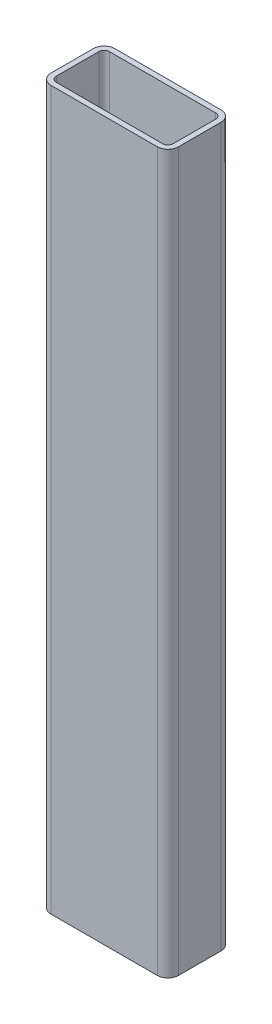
ISO-10303-21;
HEADER;
FILE_DESCRIPTION(('STEP AP214'),'2;1');
FILE_NAME('part.step','',(''),(''),'','','');
FILE_SCHEMA(('AUTOMOTIVE_DESIGN { 1 0 10303 214 1 1 1 1 }'));
ENDSEC;
DATA;
#1=APPLICATION_CONTEXT('core data for automotive mechanical design processes');
#2=APPLICATION_PROTOCOL_DEFINITION('international standard','automotive_design',2000,#1);
#3=PRODUCT_CONTEXT('',#1,'mechanical');
#4=PRODUCT('Part','Part','',(#3));
#5=PRODUCT_RELATED_PRODUCT_CATEGORY('part','',(#4));
#6=PRODUCT_DEFINITION_FORMATION('','',#4);
#7=PRODUCT_DEFINITION_CONTEXT('part definition',#1,'design');
#8=PRODUCT_DEFINITION('design','',#6,#7);
#9=PRODUCT_DEFINITION_SHAPE('','',#8);
#10=(LENGTH_UNIT() NAMED_UNIT(*) SI_UNIT(.MILLI.,.METRE.));
#11=(NAMED_UNIT(*) PLANE_ANGLE_UNIT() SI_UNIT($,.RADIAN.));
#12=(NAMED_UNIT(*) SI_UNIT($,.STERADIAN.) SOLID_ANGLE_UNIT());
#13=UNCERTAINTY_MEASURE_WITH_UNIT(LENGTH_MEASURE(1.E-05),#10,'distance_accuracy_value','');
#14=(GEOMETRIC_REPRESENTATION_CONTEXT(3) GLOBAL_UNCERTAINTY_ASSIGNED_CONTEXT((#13)) GLOBAL_UNIT_ASSIGNED_CONTEXT((#10,
#11,#12)) REPRESENTATION_CONTEXT('',''));
#15=CARTESIAN_POINT('',(0.,0.,0.));
#16=DIRECTION('',(0.,0.,1.));
#17=DIRECTION('',(1.,0.,0.));
#18=AXIS2_PLACEMENT_3D('',#15,#16,#17);
#19=CARTESIAN_POINT('',(-1118.46174535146,-2097.12163758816,-25.3999999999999));
#20=DIRECTION('',(0.,1.,0.));
#21=DIRECTION('',(0.,0.,1.));
#22=AXIS2_PLACEMENT_3D('',#19,#20,#21);
#23=CYLINDRICAL_SURFACE('',#22,25.4);
#24=CARTESIAN_POINT('',(-1118.46174535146,-382.621637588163,-25.3999999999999));
#25=DIRECTION('',(0.,-1.,0.));
#26=DIRECTION('',(0.,0.,-1.));
#27=AXIS2_PLACEMENT_3D('',#24,#25,#26);
#28=CIRCLE('',#27,25.4);
#29=CARTESIAN_POINT('',(-1118.46174535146,-382.621637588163,1.80411241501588E-13));
#30=VERTEX_POINT('',#29);
#31=CARTESIAN_POINT('',(-1143.86174535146,-382.621637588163,-25.4));
#32=VERTEX_POINT('',#31);
#33=EDGE_CURVE('E232',#30,#32,#28,.T.);
#34=ORIENTED_EDGE('',*,*,#33,.T.);
#35=DIRECTION('',(0.,1.,0.));
#36=VECTOR('',#35,1.);
#37=CARTESIAN_POINT('',(-1143.86174535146,-2097.12163758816,-25.4));
#38=LINE('',#37,#36);
#39=CARTESIAN_POINT('',(-1143.86174535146,-2097.12163758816,-25.4));
#40=VERTEX_POINT('',#39);
#41=EDGE_CURVE('E12',#40,#32,#38,.T.);
#42=ORIENTED_EDGE('',*,*,#41,.F.);
#43=CARTESIAN_POINT('',(-1118.46174535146,-2097.12163758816,-25.3999999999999));
#44=DIRECTION('',(0.,-1.,0.));
#45=DIRECTION('',(0.,0.,-1.));
#46=AXIS2_PLACEMENT_3D('',#43,#44,#45);
#47=CIRCLE('',#46,25.4);
#48=CARTESIAN_POINT('',(-1118.46174535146,-2097.12163758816,1.80411241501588E-13));
#49=VERTEX_POINT('',#48);
#50=EDGE_CURVE('E310',#49,#40,#47,.T.);
#51=ORIENTED_EDGE('',*,*,#50,.F.);
#52=DIRECTION('',(0.,1.,0.));
#53=VECTOR('',#52,1.);
#54=CARTESIAN_POINT('',(-1118.46174535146,-2097.12163758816,1.80411241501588E-13));
#55=LINE('',#54,#53);
#56=EDGE_CURVE('E247',#49,#30,#55,.T.);
#57=ORIENTED_EDGE('',*,*,#56,.T.);
#58=EDGE_LOOP('',(#34,#42,#51,#57));
#59=FACE_BOUND('',#58,.T.);
#60=ADVANCED_FACE('F60',(#59),#23,.T.);
#61=CARTESIAN_POINT('',(-1143.86174535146,-2097.12163758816,-25.4));
#62=DIRECTION('',(1.,0.,0.));
#63=DIRECTION('',(0.,0.,-1.));
#64=AXIS2_PLACEMENT_3D('',#61,#62,#63);
#65=PLANE('',#64);
#66=DIRECTION('',(0.,0.,-1.));
#67=VECTOR('',#66,1.);
#68=CARTESIAN_POINT('',(-1143.86174535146,-382.621637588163,-25.4));
#69=LINE('',#68,#67);
#70=CARTESIAN_POINT('',(-1143.86174535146,-382.621637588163,-127.));
#71=VERTEX_POINT('',#70);
#72=EDGE_CURVE('E235',#32,#71,#69,.T.);
#73=ORIENTED_EDGE('',*,*,#72,.T.);
#74=DIRECTION('',(0.,1.,0.));
#75=VECTOR('',#74,1.);
#76=CARTESIAN_POINT('',(-1143.86174535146,-2097.12163758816,-127.));
#77=LINE('',#76,#75);
#78=CARTESIAN_POINT('',(-1143.86174535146,-2097.12163758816,-127.));
#79=VERTEX_POINT('',#78);
#80=EDGE_CURVE('E70',#79,#71,#77,.T.);
#81=ORIENTED_EDGE('',*,*,#80,.F.);
#82=DIRECTION('',(0.,0.,-1.));
#83=VECTOR('',#82,1.);
#84=CARTESIAN_POINT('',(-1143.86174535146,-2097.12163758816,-25.4));
#85=LINE('',#84,#83);
#86=EDGE_CURVE('E312',#40,#79,#85,.T.);
#87=ORIENTED_EDGE('',*,*,#86,.F.);
#88=ORIENTED_EDGE('',*,*,#41,.T.);
#89=EDGE_LOOP('',(#73,#81,#87,#88));
#90=FACE_BOUND('',#89,.T.);
#91=ADVANCED_FACE('F347',(#90),#65,.F.);
#92=CARTESIAN_POINT('',(-1118.46174535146,-2097.12163758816,-127.));
#93=DIRECTION('',(0.,1.,0.));
#94=DIRECTION('',(0.,0.,1.));
#95=AXIS2_PLACEMENT_3D('',#92,#93,#94);
#96=CYLINDRICAL_SURFACE('',#95,25.4000000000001);
#97=CARTESIAN_POINT('',(-1118.46174535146,-382.621637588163,-127.));
#98=DIRECTION('',(0.,-1.,0.));
#99=DIRECTION('',(0.,0.,-1.));
#100=AXIS2_PLACEMENT_3D('',#97,#98,#99);
#101=CIRCLE('',#100,25.4000000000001);
#102=CARTESIAN_POINT('',(-1118.46174535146,-382.621637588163,-152.4));
#103=VERTEX_POINT('',#102);
#104=EDGE_CURVE('E237',#71,#103,#101,.T.);
#105=ORIENTED_EDGE('',*,*,#104,.T.);
#106=DIRECTION('',(0.,1.,0.));
#107=VECTOR('',#106,1.);
#108=CARTESIAN_POINT('',(-1118.46174535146,-2097.12163758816,-152.4));
#109=LINE('',#108,#107);
#110=CARTESIAN_POINT('',(-1118.46174535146,-2097.12163758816,-152.4));
#111=VERTEX_POINT('',#110);
#112=EDGE_CURVE('E254',#111,#103,#109,.T.);
#113=ORIENTED_EDGE('',*,*,#112,.F.);
#114=CARTESIAN_POINT('',(-1118.46174535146,-2097.12163758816,-127.));
#115=DIRECTION('',(0.,-1.,0.));
#116=DIRECTION('',(0.,0.,-1.));
#117=AXIS2_PLACEMENT_3D('',#114,#115,#116);
#118=CIRCLE('',#117,25.4000000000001);
#119=EDGE_CURVE('E314',#79,#111,#118,.T.);
#120=ORIENTED_EDGE('',*,*,#119,.F.);
#121=ORIENTED_EDGE('',*,*,#80,.T.);
#122=EDGE_LOOP('',(#105,#113,#120,#121));
#123=FACE_BOUND('',#122,.T.);
#124=ADVANCED_FACE('F352',(#123),#96,.T.);
#125=CARTESIAN_POINT('',(-864.461745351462,-2097.12163758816,-152.399999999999));
#126=DIRECTION('',(0.,0.,1.));
#127=DIRECTION('',(1.,0.,0.));
#128=AXIS2_PLACEMENT_3D('',#125,#126,#127);
#129=PLANE('',#128);
#130=DIRECTION('',(1.,0.,0.));
#131=VECTOR('',#130,1.);
#132=CARTESIAN_POINT('',(-864.461745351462,-382.621637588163,-152.399999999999));
#133=LINE('',#132,#131);
#134=CARTESIAN_POINT('',(-864.461745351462,-382.621637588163,-152.399999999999));
#135=VERTEX_POINT('',#134);
#136=EDGE_CURVE('E239',#103,#135,#133,.T.);
#137=ORIENTED_EDGE('',*,*,#136,.T.);
#138=DIRECTION('',(0.,1.,0.));
#139=VECTOR('',#138,1.);
#140=CARTESIAN_POINT('',(-864.461745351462,-2097.12163758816,-152.399999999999));
#141=LINE('',#140,#139);
#142=CARTESIAN_POINT('',(-864.461745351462,-2097.12163758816,-152.399999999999));
#143=VERTEX_POINT('',#142);
#144=EDGE_CURVE('E251',#143,#135,#141,.T.);
#145=ORIENTED_EDGE('',*,*,#144,.F.);
#146=DIRECTION('',(1.,0.,0.));
#147=VECTOR('',#146,1.);
#148=CARTESIAN_POINT('',(-864.461745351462,-2097.12163758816,-152.399999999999));
#149=LINE('',#148,#147);
#150=EDGE_CURVE('E316',#111,#143,#149,.T.);
#151=ORIENTED_EDGE('',*,*,#150,.F.);
#152=ORIENTED_EDGE('',*,*,#112,.T.);
#153=EDGE_LOOP('',(#137,#145,#151,#152));
#154=FACE_BOUND('',#153,.T.);
#155=ADVANCED_FACE('F322',(#154),#129,.F.);
#156=CARTESIAN_POINT('',(-864.461745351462,-2097.12163758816,-126.999999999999));
#157=DIRECTION('',(0.,1.,0.));
#158=DIRECTION('',(0.,0.,1.));
#159=AXIS2_PLACEMENT_3D('',#156,#157,#158);
#160=CYLINDRICAL_SURFACE('',#159,25.4);
#161=CARTESIAN_POINT('',(-864.461745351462,-382.621637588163,-126.999999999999));
#162=DIRECTION('',(0.,-1.,0.));
#163=DIRECTION('',(0.,0.,-1.));
#164=AXIS2_PLACEMENT_3D('',#161,#162,#163);
#165=CIRCLE('',#164,25.4);
#166=CARTESIAN_POINT('',(-839.061745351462,-382.621637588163,-126.999999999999));
#167=VERTEX_POINT('',#166);
#168=EDGE_CURVE('E241',#135,#167,#165,.T.);
#169=ORIENTED_EDGE('',*,*,#168,.T.);
#170=DIRECTION('',(0.,1.,0.));
#171=VECTOR('',#170,1.);
#172=CARTESIAN_POINT('',(-839.061745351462,-2097.12163758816,-126.999999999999));
#173=LINE('',#172,#171);
#174=CARTESIAN_POINT('',(-839.061745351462,-2097.12163758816,-126.999999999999));
#175=VERTEX_POINT('',#174);
#176=EDGE_CURVE('E199',#175,#167,#173,.T.);
#177=ORIENTED_EDGE('',*,*,#176,.F.);
#178=CARTESIAN_POINT('',(-864.461745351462,-2097.12163758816,-126.999999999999));
#179=DIRECTION('',(0.,-1.,0.));
#180=DIRECTION('',(0.,0.,-1.));
#181=AXIS2_PLACEMENT_3D('',#178,#179,#180);
#182=CIRCLE('',#181,25.4);
#183=EDGE_CURVE('E190',#143,#175,#182,.T.);
#184=ORIENTED_EDGE('',*,*,#183,.F.);
#185=ORIENTED_EDGE('',*,*,#144,.T.);
#186=EDGE_LOOP('',(#169,#177,#184,#185));
#187=FACE_BOUND('',#186,.T.);
#188=ADVANCED_FACE('F326',(#187),#160,.T.);
#189=CARTESIAN_POINT('',(-839.061745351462,-2097.12163758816,-126.999999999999));
#190=DIRECTION('',(-1.,0.,0.));
#191=DIRECTION('',(0.,0.,1.));
#192=AXIS2_PLACEMENT_3D('',#189,#190,#191);
#193=PLANE('',#192);
#194=DIRECTION('',(0.,0.,1.));
#195=VECTOR('',#194,1.);
#196=CARTESIAN_POINT('',(-839.061745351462,-382.621637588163,-126.999999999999));
#197=LINE('',#196,#195);
#198=CARTESIAN_POINT('',(-839.061745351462,-382.621637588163,-25.3999999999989));
#199=VERTEX_POINT('',#198);
#200=EDGE_CURVE('E198',#167,#199,#197,.T.);
#201=ORIENTED_EDGE('',*,*,#200,.T.);
#202=DIRECTION('',(0.,1.,0.));
#203=VECTOR('',#202,1.);
#204=CARTESIAN_POINT('',(-839.061745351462,-2097.12163758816,-25.3999999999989));
#205=LINE('',#204,#203);
#206=CARTESIAN_POINT('',(-839.061745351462,-2097.12163758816,-25.3999999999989));
#207=VERTEX_POINT('',#206);
#208=EDGE_CURVE('E195',#207,#199,#205,.T.);
#209=ORIENTED_EDGE('',*,*,#208,.F.);
#210=DIRECTION('',(0.,0.,1.));
#211=VECTOR('',#210,1.);
#212=CARTESIAN_POINT('',(-839.061745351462,-2097.12163758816,-126.999999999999));
#213=LINE('',#212,#211);
#214=EDGE_CURVE('E184',#175,#207,#213,.T.);
#215=ORIENTED_EDGE('',*,*,#214,.F.);
#216=ORIENTED_EDGE('',*,*,#176,.T.);
#217=EDGE_LOOP('',(#201,#209,#215,#216));
#218=FACE_BOUND('',#217,.T.);
#219=ADVANCED_FACE('F196',(#218),#193,.F.);
#220=CARTESIAN_POINT('',(-864.461745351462,-2097.12163758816,-25.399999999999));
#221=DIRECTION('',(0.,1.,0.));
#222=DIRECTION('',(0.,0.,1.));
#223=AXIS2_PLACEMENT_3D('',#220,#221,#222);
#224=CYLINDRICAL_SURFACE('',#223,25.4000000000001);
#225=CARTESIAN_POINT('',(-864.461745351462,-382.621637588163,-25.399999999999));
#226=DIRECTION('',(0.,-1.,0.));
#227=DIRECTION('',(0.,0.,-1.));
#228=AXIS2_PLACEMENT_3D('',#225,#226,#227);
#229=CIRCLE('',#228,25.4000000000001);
#230=CARTESIAN_POINT('',(-864.461745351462,-382.621637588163,1.06858966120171E-12));
#231=VERTEX_POINT('',#230);
#232=EDGE_CURVE('E132',#199,#231,#229,.T.);
#233=ORIENTED_EDGE('',*,*,#232,.T.);
#234=DIRECTION('',(0.,1.,0.));
#235=VECTOR('',#234,1.);
#236=CARTESIAN_POINT('',(-864.461745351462,-2097.12163758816,1.06858966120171E-12));
#237=LINE('',#236,#235);
#238=CARTESIAN_POINT('',(-864.461745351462,-2097.12163758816,1.06858966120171E-12));
#239=VERTEX_POINT('',#238);
#240=EDGE_CURVE('E200',#239,#231,#237,.T.);
#241=ORIENTED_EDGE('',*,*,#240,.F.);
#242=CARTESIAN_POINT('',(-864.461745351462,-2097.12163758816,-25.399999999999));
#243=DIRECTION('',(0.,-1.,0.));
#244=DIRECTION('',(0.,0.,-1.));
#245=AXIS2_PLACEMENT_3D('',#242,#243,#244);
#246=CIRCLE('',#245,25.4000000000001);
#247=EDGE_CURVE('E188',#207,#239,#246,.T.);
#248=ORIENTED_EDGE('',*,*,#247,.F.);
#249=ORIENTED_EDGE('',*,*,#208,.T.);
#250=EDGE_LOOP('',(#233,#241,#248,#249));
#251=FACE_BOUND('',#250,.T.);
#252=ADVANCED_FACE('F202',(#251),#224,.T.);
#253=CARTESIAN_POINT('',(-1118.46174535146,-2097.12163758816,-127.));
#254=DIRECTION('',(0.,1.,0.));
#255=DIRECTION('',(0.,0.,1.));
#256=AXIS2_PLACEMENT_3D('',#253,#254,#255);
#257=CYLINDRICAL_SURFACE('',#256,12.7);
#258=CARTESIAN_POINT('',(-1118.46174535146,-382.621637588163,-127.));
#259=DIRECTION('',(0.,-1.,0.));
#260=DIRECTION('',(0.,0.,-1.));
#261=AXIS2_PLACEMENT_3D('',#258,#259,#260);
#262=CIRCLE('',#261,12.7);
#263=CARTESIAN_POINT('',(-1131.16174535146,-382.621637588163,-127.));
#264=VERTEX_POINT('',#263);
#265=CARTESIAN_POINT('',(-1118.46174535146,-382.621637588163,-139.7));
#266=VERTEX_POINT('',#265);
#267=EDGE_CURVE('E208',#264,#266,#262,.T.);
#268=ORIENTED_EDGE('',*,*,#267,.F.);
#269=DIRECTION('',(0.,1.,0.));
#270=VECTOR('',#269,1.);
#271=CARTESIAN_POINT('',(-1131.16174535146,-2097.12163758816,-127.));
#272=LINE('',#271,#270);
#273=CARTESIAN_POINT('',(-1131.16174535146,-2097.12163758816,-127.));
#274=VERTEX_POINT('',#273);
#275=EDGE_CURVE('E64',#274,#264,#272,.T.);
#276=ORIENTED_EDGE('',*,*,#275,.F.);
#277=CARTESIAN_POINT('',(-1118.46174535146,-2097.12163758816,-127.));
#278=DIRECTION('',(0.,-1.,0.));
#279=DIRECTION('',(0.,0.,-1.));
#280=AXIS2_PLACEMENT_3D('',#277,#278,#279);
#281=CIRCLE('',#280,12.7);
#282=CARTESIAN_POINT('',(-1118.46174535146,-2097.12163758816,-139.7));
#283=VERTEX_POINT('',#282);
#284=EDGE_CURVE('E246',#274,#283,#281,.T.);
#285=ORIENTED_EDGE('',*,*,#284,.T.);
#286=DIRECTION('',(0.,1.,0.));
#287=VECTOR('',#286,1.);
#288=CARTESIAN_POINT('',(-1118.46174535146,-2097.12163758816,-139.7));
#289=LINE('',#288,#287);
#290=EDGE_CURVE('E204',#283,#266,#289,.T.);
#291=ORIENTED_EDGE('',*,*,#290,.T.);
#292=EDGE_LOOP('',(#268,#276,#285,#291));
#293=FACE_BOUND('',#292,.T.);
#294=ADVANCED_FACE('F62',(#293),#257,.F.);
#295=CARTESIAN_POINT('',(-1131.16174535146,-2097.12163758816,-25.4));
#296=DIRECTION('',(1.,0.,0.));
#297=DIRECTION('',(0.,0.,-1.));
#298=AXIS2_PLACEMENT_3D('',#295,#296,#297);
#299=PLANE('',#298);
#300=DIRECTION('',(0.,0.,-1.));
#301=VECTOR('',#300,1.);
#302=CARTESIAN_POINT('',(-1131.16174535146,-382.621637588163,-25.4));
#303=LINE('',#302,#301);
#304=CARTESIAN_POINT('',(-1131.16174535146,-382.621637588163,-25.4));
#305=VERTEX_POINT('',#304);
#306=EDGE_CURVE('E211',#305,#264,#303,.T.);
#307=ORIENTED_EDGE('',*,*,#306,.F.);
#308=DIRECTION('',(0.,1.,0.));
#309=VECTOR('',#308,1.);
#310=CARTESIAN_POINT('',(-1131.16174535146,-2097.12163758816,-25.4));
#311=LINE('',#310,#309);
#312=CARTESIAN_POINT('',(-1131.16174535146,-2097.12163758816,-25.4));
#313=VERTEX_POINT('',#312);
#314=EDGE_CURVE('E269',#313,#305,#311,.T.);
#315=ORIENTED_EDGE('',*,*,#314,.F.);
#316=DIRECTION('',(0.,0.,-1.));
#317=VECTOR('',#316,1.);
#318=CARTESIAN_POINT('',(-1131.16174535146,-2097.12163758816,-25.4));
#319=LINE('',#318,#317);
#320=EDGE_CURVE('E278',#313,#274,#319,.T.);
#321=ORIENTED_EDGE('',*,*,#320,.T.);
#322=ORIENTED_EDGE('',*,*,#275,.T.);
#323=EDGE_LOOP('',(#307,#315,#321,#322));
#324=FACE_BOUND('',#323,.T.);
#325=ADVANCED_FACE('F276',(#324),#299,.T.);
#326=CARTESIAN_POINT('',(-1118.46174535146,-2097.12163758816,-25.3999999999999));
#327=DIRECTION('',(0.,1.,0.));
#328=DIRECTION('',(0.,0.,1.));
#329=AXIS2_PLACEMENT_3D('',#326,#327,#328);
#330=CYLINDRICAL_SURFACE('',#329,12.7);
#331=CARTESIAN_POINT('',(-1118.46174535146,-382.621637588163,-25.3999999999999));
#332=DIRECTION('',(0.,-1.,0.));
#333=DIRECTION('',(0.,0.,-1.));
#334=AXIS2_PLACEMENT_3D('',#331,#332,#333);
#335=CIRCLE('',#334,12.7);
#336=CARTESIAN_POINT('',(-1118.46174535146,-382.621637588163,-12.6999999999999));
#337=VERTEX_POINT('',#336);
#338=EDGE_CURVE('E214',#337,#305,#335,.T.);
#339=ORIENTED_EDGE('',*,*,#338,.F.);
#340=DIRECTION('',(0.,1.,0.));
#341=VECTOR('',#340,1.);
#342=CARTESIAN_POINT('',(-1118.46174535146,-2097.12163758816,-12.6999999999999));
#343=LINE('',#342,#341);
#344=CARTESIAN_POINT('',(-1118.46174535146,-2097.12163758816,-12.6999999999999));
#345=VERTEX_POINT('',#344);
#346=EDGE_CURVE('E268',#345,#337,#343,.T.);
#347=ORIENTED_EDGE('',*,*,#346,.F.);
#348=CARTESIAN_POINT('',(-1118.46174535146,-2097.12163758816,-25.3999999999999));
#349=DIRECTION('',(0.,-1.,0.));
#350=DIRECTION('',(0.,0.,-1.));
#351=AXIS2_PLACEMENT_3D('',#348,#349,#350);
#352=CIRCLE('',#351,12.7);
#353=EDGE_CURVE('E286',#345,#313,#352,.T.);
#354=ORIENTED_EDGE('',*,*,#353,.T.);
#355=ORIENTED_EDGE('',*,*,#314,.T.);
#356=EDGE_LOOP('',(#339,#347,#354,#355));
#357=FACE_BOUND('',#356,.T.);
#358=ADVANCED_FACE('F284',(#357),#330,.F.);
#359=CARTESIAN_POINT('',(-1118.46174535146,-2097.12163758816,-12.6999999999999));
#360=DIRECTION('',(0.,0.,-1.));
#361=DIRECTION('',(-1.,0.,0.));
#362=AXIS2_PLACEMENT_3D('',#359,#360,#361);
#363=PLANE('',#362);
#364=DIRECTION('',(-1.,0.,0.));
#365=VECTOR('',#364,1.);
#366=CARTESIAN_POINT('',(-1118.46174535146,-382.621637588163,-12.6999999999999));
#367=LINE('',#366,#365);
#368=CARTESIAN_POINT('',(-864.461745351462,-382.621637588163,-12.699999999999));
#369=VERTEX_POINT('',#368);
#370=EDGE_CURVE('E217',#369,#337,#367,.T.);
#371=ORIENTED_EDGE('',*,*,#370,.F.);
#372=DIRECTION('',(0.,1.,0.));
#373=VECTOR('',#372,1.);
#374=CARTESIAN_POINT('',(-864.461745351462,-2097.12163758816,-12.699999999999));
#375=LINE('',#374,#373);
#376=CARTESIAN_POINT('',(-864.461745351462,-2097.12163758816,-12.699999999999));
#377=VERTEX_POINT('',#376);
#378=EDGE_CURVE('E266',#377,#369,#375,.T.);
#379=ORIENTED_EDGE('',*,*,#378,.F.);
#380=DIRECTION('',(-1.,0.,0.));
#381=VECTOR('',#380,1.);
#382=CARTESIAN_POINT('',(-1118.46174535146,-2097.12163758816,-12.6999999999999));
#383=LINE('',#382,#381);
#384=EDGE_CURVE('E292',#377,#345,#383,.T.);
#385=ORIENTED_EDGE('',*,*,#384,.T.);
#386=ORIENTED_EDGE('',*,*,#346,.T.);
#387=EDGE_LOOP('',(#371,#379,#385,#386));
#388=FACE_BOUND('',#387,.T.);
#389=ADVANCED_FACE('F295',(#388),#363,.T.);
#390=CARTESIAN_POINT('',(-864.461745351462,-2097.12163758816,-25.399999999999));
#391=DIRECTION('',(0.,1.,0.));
#392=DIRECTION('',(0.,0.,1.));
#393=AXIS2_PLACEMENT_3D('',#390,#391,#392);
#394=CYLINDRICAL_SURFACE('',#393,12.7);
#395=CARTESIAN_POINT('',(-864.461745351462,-382.621637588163,-25.399999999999));
#396=DIRECTION('',(0.,-1.,0.));
#397=DIRECTION('',(0.,0.,-1.));
#398=AXIS2_PLACEMENT_3D('',#395,#396,#397);
#399=CIRCLE('',#398,12.7);
#400=CARTESIAN_POINT('',(-851.761745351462,-382.621637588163,-25.399999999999));
#401=VERTEX_POINT('',#400);
#402=EDGE_CURVE('E220',#401,#369,#399,.T.);
#403=ORIENTED_EDGE('',*,*,#402,.F.);
#404=DIRECTION('',(0.,1.,0.));
#405=VECTOR('',#404,1.);
#406=CARTESIAN_POINT('',(-851.761745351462,-2097.12163758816,-25.399999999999));
#407=LINE('',#406,#405);
#408=CARTESIAN_POINT('',(-851.761745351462,-2097.12163758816,-25.399999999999));
#409=VERTEX_POINT('',#408);
#410=EDGE_CURVE('E264',#409,#401,#407,.T.);
#411=ORIENTED_EDGE('',*,*,#410,.F.);
#412=CARTESIAN_POINT('',(-864.461745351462,-2097.12163758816,-25.399999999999));
#413=DIRECTION('',(0.,-1.,0.));
#414=DIRECTION('',(0.,0.,-1.));
#415=AXIS2_PLACEMENT_3D('',#412,#413,#414);
#416=CIRCLE('',#415,12.7);
#417=EDGE_CURVE('E296',#409,#377,#416,.T.);
#418=ORIENTED_EDGE('',*,*,#417,.T.);
#419=ORIENTED_EDGE('',*,*,#378,.T.);
#420=EDGE_LOOP('',(#403,#411,#418,#419));
#421=FACE_BOUND('',#420,.T.);
#422=ADVANCED_FACE('F363',(#421),#394,.F.);
#423=CARTESIAN_POINT('',(-851.761745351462,-2097.12163758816,-126.999999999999));
#424=DIRECTION('',(-1.,0.,0.));
#425=DIRECTION('',(0.,0.,1.));
#426=AXIS2_PLACEMENT_3D('',#423,#424,#425);
#427=PLANE('',#426);
#428=DIRECTION('',(0.,0.,1.));
#429=VECTOR('',#428,1.);
#430=CARTESIAN_POINT('',(-851.761745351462,-382.621637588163,-126.999999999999));
#431=LINE('',#430,#429);
#432=CARTESIAN_POINT('',(-851.761745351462,-382.621637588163,-126.999999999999));
#433=VERTEX_POINT('',#432);
#434=EDGE_CURVE('E223',#433,#401,#431,.T.);
#435=ORIENTED_EDGE('',*,*,#434,.F.);
#436=DIRECTION('',(0.,1.,0.));
#437=VECTOR('',#436,1.);
#438=CARTESIAN_POINT('',(-851.761745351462,-2097.12163758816,-126.999999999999));
#439=LINE('',#438,#437);
#440=CARTESIAN_POINT('',(-851.761745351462,-2097.12163758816,-126.999999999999));
#441=VERTEX_POINT('',#440);
#442=EDGE_CURVE('E262',#441,#433,#439,.T.);
#443=ORIENTED_EDGE('',*,*,#442,.F.);
#444=DIRECTION('',(0.,0.,1.));
#445=VECTOR('',#444,1.);
#446=CARTESIAN_POINT('',(-851.761745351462,-2097.12163758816,-126.999999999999));
#447=LINE('',#446,#445);
#448=EDGE_CURVE('E298',#441,#409,#447,.T.);
#449=ORIENTED_EDGE('',*,*,#448,.T.);
#450=ORIENTED_EDGE('',*,*,#410,.T.);
#451=EDGE_LOOP('',(#435,#443,#449,#450));
#452=FACE_BOUND('',#451,.T.);
#453=ADVANCED_FACE('F359',(#452),#427,.T.);
#454=CARTESIAN_POINT('',(-864.461745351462,-2097.12163758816,-126.999999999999));
#455=DIRECTION('',(0.,1.,0.));
#456=DIRECTION('',(0.,0.,1.));
#457=AXIS2_PLACEMENT_3D('',#454,#455,#456);
#458=CYLINDRICAL_SURFACE('',#457,12.7);
#459=CARTESIAN_POINT('',(-864.461745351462,-382.621637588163,-126.999999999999));
#460=DIRECTION('',(0.,-1.,0.));
#461=DIRECTION('',(0.,0.,-1.));
#462=AXIS2_PLACEMENT_3D('',#459,#460,#461);
#463=CIRCLE('',#462,12.7);
#464=CARTESIAN_POINT('',(-864.461745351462,-382.621637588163,-139.699999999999));
#465=VERTEX_POINT('',#464);
#466=EDGE_CURVE('E226',#465,#433,#463,.T.);
#467=ORIENTED_EDGE('',*,*,#466,.F.);
#468=DIRECTION('',(0.,1.,0.));
#469=VECTOR('',#468,1.);
#470=CARTESIAN_POINT('',(-864.461745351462,-2097.12163758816,-139.699999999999));
#471=LINE('',#470,#469);
#472=CARTESIAN_POINT('',(-864.461745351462,-2097.12163758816,-139.699999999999));
#473=VERTEX_POINT('',#472);
#474=EDGE_CURVE('E260',#473,#465,#471,.T.);
#475=ORIENTED_EDGE('',*,*,#474,.F.);
#476=CARTESIAN_POINT('',(-864.461745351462,-2097.12163758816,-126.999999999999));
#477=DIRECTION('',(0.,-1.,0.));
#478=DIRECTION('',(0.,0.,-1.));
#479=AXIS2_PLACEMENT_3D('',#476,#477,#478);
#480=CIRCLE('',#479,12.7);
#481=EDGE_CURVE('E304',#473,#441,#480,.T.);
#482=ORIENTED_EDGE('',*,*,#481,.T.);
#483=ORIENTED_EDGE('',*,*,#442,.T.);
#484=EDGE_LOOP('',(#467,#475,#482,#483));
#485=FACE_BOUND('',#484,.T.);
#486=ADVANCED_FACE('F341',(#485),#458,.F.);
#487=CARTESIAN_POINT('',(-864.461745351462,-2097.12163758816,-139.699999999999));
#488=DIRECTION('',(0.,0.,1.));
#489=DIRECTION('',(1.,0.,0.));
#490=AXIS2_PLACEMENT_3D('',#487,#488,#489);
#491=PLANE('',#490);
#492=DIRECTION('',(1.,0.,0.));
#493=VECTOR('',#492,1.);
#494=CARTESIAN_POINT('',(-864.461745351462,-382.621637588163,-139.699999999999));
#495=LINE('',#494,#493);
#496=EDGE_CURVE('E229',#266,#465,#495,.T.);
#497=ORIENTED_EDGE('',*,*,#496,.F.);
#498=ORIENTED_EDGE('',*,*,#290,.F.);
#499=DIRECTION('',(1.,0.,0.));
#500=VECTOR('',#499,1.);
#501=CARTESIAN_POINT('',(-864.461745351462,-2097.12163758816,-139.699999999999));
#502=LINE('',#501,#500);
#503=EDGE_CURVE('E307',#283,#473,#502,.T.);
#504=ORIENTED_EDGE('',*,*,#503,.T.);
#505=ORIENTED_EDGE('',*,*,#474,.T.);
#506=EDGE_LOOP('',(#497,#498,#504,#505));
#507=FACE_BOUND('',#506,.T.);
#508=ADVANCED_FACE('F334',(#507),#491,.T.);
#509=CARTESIAN_POINT('',(-1118.46174535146,-2097.12163758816,1.80411241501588E-13));
#510=DIRECTION('',(0.,0.,-1.));
#511=DIRECTION('',(-1.,0.,0.));
#512=AXIS2_PLACEMENT_3D('',#509,#510,#511);
#513=PLANE('',#512);
#514=DIRECTION('',(-1.,0.,0.));
#515=VECTOR('',#514,1.);
#516=CARTESIAN_POINT('',(-1118.46174535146,-382.621637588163,1.80411241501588E-13));
#517=LINE('',#516,#515);
#518=EDGE_CURVE('E138',#231,#30,#517,.T.);
#519=ORIENTED_EDGE('',*,*,#518,.T.);
#520=ORIENTED_EDGE('',*,*,#56,.F.);
#521=DIRECTION('',(-1.,0.,0.));
#522=VECTOR('',#521,1.);
#523=CARTESIAN_POINT('',(-1118.46174535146,-2097.12163758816,1.80411241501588E-13));
#524=LINE('',#523,#522);
#525=EDGE_CURVE('E79',#239,#49,#524,.T.);
#526=ORIENTED_EDGE('',*,*,#525,.F.);
#527=ORIENTED_EDGE('',*,*,#240,.T.);
#528=EDGE_LOOP('',(#519,#520,#526,#527));
#529=FACE_BOUND('',#528,.T.);
#530=ADVANCED_FACE('F332',(#529),#513,.F.);
#531=CARTESIAN_POINT('',(-1118.46174535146,-2097.12163758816,-25.3999999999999));
#532=DIRECTION('',(0.,-1.,0.));
#533=DIRECTION('',(0.,0.,-1.));
#534=AXIS2_PLACEMENT_3D('',#531,#532,#533);
#535=PLANE('',#534);
#536=ORIENTED_EDGE('',*,*,#284,.F.);
#537=ORIENTED_EDGE('',*,*,#320,.F.);
#538=ORIENTED_EDGE('',*,*,#353,.F.);
#539=ORIENTED_EDGE('',*,*,#384,.F.);
#540=ORIENTED_EDGE('',*,*,#417,.F.);
#541=ORIENTED_EDGE('',*,*,#448,.F.);
#542=ORIENTED_EDGE('',*,*,#481,.F.);
#543=ORIENTED_EDGE('',*,*,#503,.F.);
#544=EDGE_LOOP('',(#536,#537,#538,#539,#540,#541,#542,#543));
#545=FACE_BOUND('',#544,.T.);
#546=ORIENTED_EDGE('',*,*,#50,.T.);
#547=ORIENTED_EDGE('',*,*,#86,.T.);
#548=ORIENTED_EDGE('',*,*,#119,.T.);
#549=ORIENTED_EDGE('',*,*,#150,.T.);
#550=ORIENTED_EDGE('',*,*,#183,.T.);
#551=ORIENTED_EDGE('',*,*,#214,.T.);
#552=ORIENTED_EDGE('',*,*,#247,.T.);
#553=ORIENTED_EDGE('',*,*,#525,.T.);
#554=EDGE_LOOP('',(#546,#547,#548,#549,#550,#551,#552,#553));
#555=FACE_BOUND('',#554,.T.);
#556=ADVANCED_FACE('F186',(#545,#555),#535,.T.);
#557=CARTESIAN_POINT('',(-1118.46174535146,-382.621637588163,-25.3999999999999));
#558=DIRECTION('',(0.,-1.,0.));
#559=DIRECTION('',(0.,0.,-1.));
#560=AXIS2_PLACEMENT_3D('',#557,#558,#559);
#561=PLANE('',#560);
#562=ORIENTED_EDGE('',*,*,#267,.T.);
#563=ORIENTED_EDGE('',*,*,#496,.T.);
#564=ORIENTED_EDGE('',*,*,#466,.T.);
#565=ORIENTED_EDGE('',*,*,#434,.T.);
#566=ORIENTED_EDGE('',*,*,#402,.T.);
#567=ORIENTED_EDGE('',*,*,#370,.T.);
#568=ORIENTED_EDGE('',*,*,#338,.T.);
#569=ORIENTED_EDGE('',*,*,#306,.T.);
#570=EDGE_LOOP('',(#562,#563,#564,#565,#566,#567,#568,#569));
#571=FACE_BOUND('',#570,.T.);
#572=ORIENTED_EDGE('',*,*,#33,.F.);
#573=ORIENTED_EDGE('',*,*,#518,.F.);
#574=ORIENTED_EDGE('',*,*,#232,.F.);
#575=ORIENTED_EDGE('',*,*,#200,.F.);
#576=ORIENTED_EDGE('',*,*,#168,.F.);
#577=ORIENTED_EDGE('',*,*,#136,.F.);
#578=ORIENTED_EDGE('',*,*,#104,.F.);
#579=ORIENTED_EDGE('',*,*,#72,.F.);
#580=EDGE_LOOP('',(#572,#573,#574,#575,#576,#577,#578,#579));
#581=FACE_BOUND('',#580,.T.);
#582=ADVANCED_FACE('F281',(#571,#581),#561,.F.);
#583=CLOSED_SHELL('',(#60,#91,#124,#155,#188,#219,#252,#294,#325,#358,#389,#422,#453,#486,#508,
#530,#556,#582));
#584=MANIFOLD_SOLID_BREP('B2',#583);
#585=ADVANCED_BREP_SHAPE_REPRESENTATION('',(#18,#584),#14);
#586=SHAPE_DEFINITION_REPRESENTATION(#9,#585);
ENDSEC;
END-ISO-10303-21;
